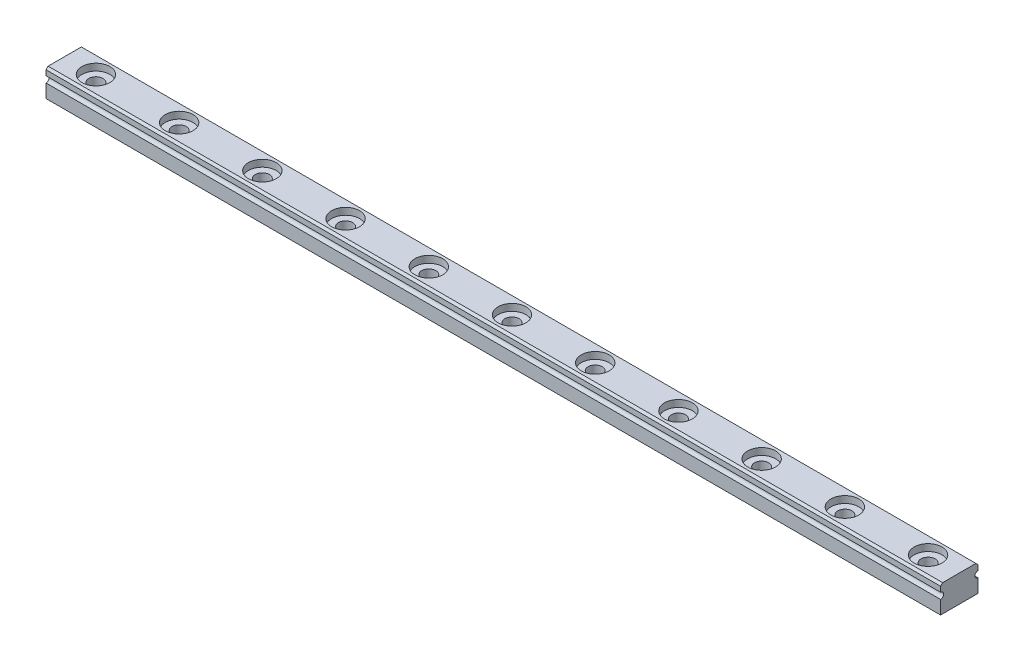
from build123d import *

# Parameters (mm, degrees)
AUFSATZ_LINEAR_AUSTRAGEN1_DEPTH = 215
FASE1_SIZE                      = 0.5
CBORE_FOR_M3_SBHCS1_D           = 3.4
CBORE_FOR_M3_SBHCS1_CBORE_D     = 6.7
CBORE_FOR_M3_SBHCS1_CBORE_DEPTH = 1.65


with BuildPart() as part:
    # Skizze1 → Aufsatz-Linear austragen1 (new body)
    with BuildSketch(Plane(origin=(0, 0, 0), x_dir=(0, 0, -1), z_dir=(1, 0, 0))):
        with BuildLine():
            Line((4.5, -3.25), (-4.5, -3.25))
            Line((-4.5, -3.25), (-4.5, 0))
            ThreePointArc((-4.5, 0), (-3.75, 0.75), (-4.5, 1.5))
            Line((-4.5, 1.5), (-4.5, 3.25))
            Line((-4.5, 3.25), (4.5, 3.25))
            Line((4.5, 3.25), (4.5, 1.5))
            ThreePointArc((4.5, 1.5), (3.75, 0.75), (4.5, 0))
            Line((4.5, 0), (4.5, -3.25))
        make_face()
    extrude(amount=AUFSATZ_LINEAR_AUSTRAGEN1_DEPTH)

    # Fase1
    fase1_edges = [part.edges().sort_by_distance(p)[0] for p in [
        (107.5, 3.25, 4.5),
        (107.5, 3.25, -4.5),
    ]]
    chamfer(fase1_edges, length=FASE1_SIZE)

    # CBORE for M3 SBHCS1 (through all)
    with Locations(Plane(origin=(0, 3.25, 0), x_dir=(1, 0, 0), z_dir=(0, 1, 0))):
        with Locations((207.5, 0), (187.5, 0), (167.5, 0), (147.5, 0), (127.5, 0), (107.5, 0), (87.5, 0), (67.5, 0), (47.5, 0), (27.5, 0), (7.5, 0)):
            CounterBoreHole(CBORE_FOR_M3_SBHCS1_D / 2, CBORE_FOR_M3_SBHCS1_CBORE_D / 2, CBORE_FOR_M3_SBHCS1_CBORE_DEPTH)


solid = part.part
